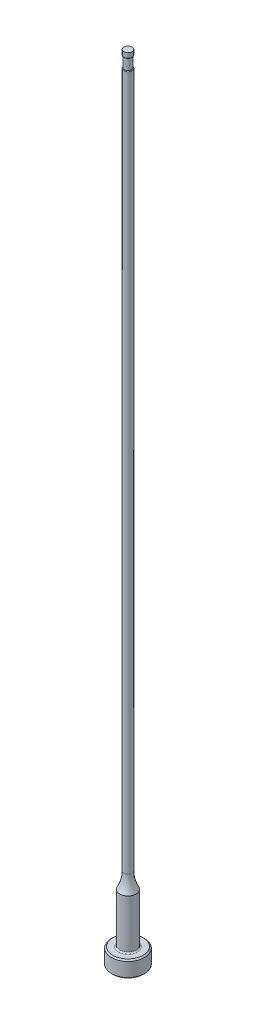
ISO-10303-21;
HEADER;
FILE_DESCRIPTION(('STEP AP214'),'2;1');
FILE_NAME('part.step','',(''),(''),'','','');
FILE_SCHEMA(('AUTOMOTIVE_DESIGN { 1 0 10303 214 1 1 1 1 }'));
ENDSEC;
DATA;
#1=APPLICATION_CONTEXT('core data for automotive mechanical design processes');
#2=APPLICATION_PROTOCOL_DEFINITION('international standard','automotive_design',2000,#1);
#3=PRODUCT_CONTEXT('',#1,'mechanical');
#4=PRODUCT('Part','Part','',(#3));
#5=PRODUCT_RELATED_PRODUCT_CATEGORY('part','',(#4));
#6=PRODUCT_DEFINITION_FORMATION('','',#4);
#7=PRODUCT_DEFINITION_CONTEXT('part definition',#1,'design');
#8=PRODUCT_DEFINITION('design','',#6,#7);
#9=PRODUCT_DEFINITION_SHAPE('','',#8);
#10=(LENGTH_UNIT() NAMED_UNIT(*) SI_UNIT(.MILLI.,.METRE.));
#11=(NAMED_UNIT(*) PLANE_ANGLE_UNIT() SI_UNIT($,.RADIAN.));
#12=(NAMED_UNIT(*) SI_UNIT($,.STERADIAN.) SOLID_ANGLE_UNIT());
#13=UNCERTAINTY_MEASURE_WITH_UNIT(LENGTH_MEASURE(1.E-05),#10,'distance_accuracy_value','');
#14=(GEOMETRIC_REPRESENTATION_CONTEXT(3) GLOBAL_UNCERTAINTY_ASSIGNED_CONTEXT((#13)) GLOBAL_UNIT_ASSIGNED_CONTEXT((#10,
#11,#12)) REPRESENTATION_CONTEXT('',''));
#15=CARTESIAN_POINT('',(0.,0.,0.));
#16=DIRECTION('',(0.,0.,1.));
#17=DIRECTION('',(1.,0.,0.));
#18=AXIS2_PLACEMENT_3D('',#15,#16,#17);
#19=CARTESIAN_POINT('',(0.,259.958771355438,0.));
#20=DIRECTION('',(0.,1.,0.));
#21=DIRECTION('',(0.,0.,1.));
#22=AXIS2_PLACEMENT_3D('',#19,#20,#21);
#23=CYLINDRICAL_SURFACE('',#22,0.79374999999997);
#24=DIRECTION('',(0.,1.,0.));
#25=VECTOR('',#24,1.);
#26=CARTESIAN_POINT('',(-0.692149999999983,259.958771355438,-0.388545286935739));
#27=LINE('',#26,#25);
#28=CARTESIAN_POINT('',(-0.692149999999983,149.227565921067,-0.388545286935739));
#29=VERTEX_POINT('',#28);
#30=CARTESIAN_POINT('',(-0.692149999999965,112.268,-0.388545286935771));
#31=VERTEX_POINT('',#30);
#32=EDGE_CURVE('E66',#29,#31,#27,.F.);
#33=ORIENTED_EDGE('',*,*,#32,.F.);
#34=CARTESIAN_POINT('',(0.,149.227565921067,0.));
#35=DIRECTION('',(0.,1.,0.));
#36=DIRECTION('',(0.,0.,1.));
#37=AXIS2_PLACEMENT_3D('',#34,#35,#36);
#38=CIRCLE('',#37,0.79374999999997);
#39=CARTESIAN_POINT('',(-0.692149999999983,149.227565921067,0.388545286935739));
#40=VERTEX_POINT('',#39);
#41=EDGE_CURVE('E44',#29,#40,#38,.F.);
#42=ORIENTED_EDGE('',*,*,#41,.T.);
#43=DIRECTION('',(0.,1.,0.));
#44=VECTOR('',#43,1.);
#45=CARTESIAN_POINT('',(-0.692149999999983,259.958771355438,0.388545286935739));
#46=LINE('',#45,#44);
#47=CARTESIAN_POINT('',(-0.692149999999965,112.268,0.388545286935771));
#48=VERTEX_POINT('',#47);
#49=EDGE_CURVE('E72',#48,#40,#46,.T.);
#50=ORIENTED_EDGE('',*,*,#49,.F.);
#51=CARTESIAN_POINT('',(-0.692149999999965,112.268,-0.388545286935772));
#52=CARTESIAN_POINT('',(-0.692147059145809,112.234595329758,-0.388529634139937));
#53=CARTESIAN_POINT('',(-0.692677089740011,112.201184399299,-0.387605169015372));
#54=CARTESIAN_POINT('',(-0.694785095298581,112.134441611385,-0.383825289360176));
#55=CARTESIAN_POINT('',(-0.696365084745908,112.101110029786,-0.380966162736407));
#56=CARTESIAN_POINT('',(-0.700560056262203,112.034665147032,-0.373193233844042));
#57=CARTESIAN_POINT('',(-0.703177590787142,112.001552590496,-0.368274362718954));
#58=CARTESIAN_POINT('',(-0.70939790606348,111.935866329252,-0.356147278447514));
#59=CARTESIAN_POINT('',(-0.712999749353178,111.903292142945,-0.348941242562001));
#60=CARTESIAN_POINT('',(-0.720516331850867,111.843629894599,-0.333107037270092));
#61=CARTESIAN_POINT('',(-0.724309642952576,111.816432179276,-0.324837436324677));
#62=CARTESIAN_POINT('',(-0.732469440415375,111.762890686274,-0.305996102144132));
#63=CARTESIAN_POINT('',(-0.736836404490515,111.736547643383,-0.295422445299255));
#64=CARTESIAN_POINT('',(-0.746025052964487,111.684994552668,-0.271391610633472));
#65=CARTESIAN_POINT('',(-0.75085027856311,111.659796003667,-0.257910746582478));
#66=CARTESIAN_POINT('',(-0.760636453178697,111.611650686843,-0.227438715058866));
#67=CARTESIAN_POINT('',(-0.765596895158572,111.588696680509,-0.210459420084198));
#68=CARTESIAN_POINT('',(-0.772863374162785,111.556559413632,-0.181185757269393));
#69=CARTESIAN_POINT('',(-0.775317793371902,111.545987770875,-0.170459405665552));
#70=CARTESIAN_POINT('',(-0.779981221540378,111.526302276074,-0.147661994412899));
#71=CARTESIAN_POINT('',(-0.782190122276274,111.517189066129,-0.135590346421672));
#72=CARTESIAN_POINT('',(-0.786212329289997,111.50084932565,-0.10990918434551));
#73=CARTESIAN_POINT('',(-0.788019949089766,111.493649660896,-0.0962812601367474));
#74=CARTESIAN_POINT('',(-0.790974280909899,111.481994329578,-0.0678329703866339));
#75=CARTESIAN_POINT('',(-0.792122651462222,111.477531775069,-0.0530157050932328));
#76=CARTESIAN_POINT('',(-0.793477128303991,111.472282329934,-0.0246588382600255));
#77=CARTESIAN_POINT('',(-0.793785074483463,111.471097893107,-0.0111986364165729));
#78=CARTESIAN_POINT('',(-0.793708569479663,111.471392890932,0.0156909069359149));
#79=CARTESIAN_POINT('',(-0.793324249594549,111.472871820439,0.0291202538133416));
#80=CARTESIAN_POINT('',(-0.792034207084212,111.477877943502,0.0533347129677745));
#81=CARTESIAN_POINT('',(-0.791220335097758,111.481045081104,0.064202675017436));
#82=CARTESIAN_POINT('',(-0.789221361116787,111.488900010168,0.0853309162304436));
#83=CARTESIAN_POINT('',(-0.78803617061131,111.493588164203,0.0955910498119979));
#84=CARTESIAN_POINT('',(-0.784691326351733,111.506986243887,0.120537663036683));
#85=CARTESIAN_POINT('',(-0.782345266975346,111.516520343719,0.134755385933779));
#86=CARTESIAN_POINT('',(-0.777271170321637,111.537662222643,0.161475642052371));
#87=CARTESIAN_POINT('',(-0.774542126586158,111.549275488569,0.173973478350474));
#88=CARTESIAN_POINT('',(-0.76709792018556,111.581902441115,0.204925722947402));
#89=CARTESIAN_POINT('',(-0.762235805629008,111.604152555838,0.222031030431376));
#90=CARTESIAN_POINT('',(-0.752599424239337,111.650926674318,0.252764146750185));
#91=CARTESIAN_POINT('',(-0.747825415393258,111.675456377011,0.26638290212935));
#92=CARTESIAN_POINT('',(-0.734693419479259,111.747796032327,0.30145019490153));
#93=CARTESIAN_POINT('',(-0.726816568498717,111.797351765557,0.319450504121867));
#94=CARTESIAN_POINT('',(-0.713277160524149,111.898727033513,0.348596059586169));
#95=CARTESIAN_POINT('',(-0.707621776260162,111.950553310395,0.359719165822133));
#96=CARTESIAN_POINT('',(-0.699557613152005,112.046820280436,0.375130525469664));
#97=CARTESIAN_POINT('',(-0.696772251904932,112.091103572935,0.380231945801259));
#98=CARTESIAN_POINT('',(-0.693072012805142,112.179601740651,0.386898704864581));
#99=CARTESIAN_POINT('',(-0.692139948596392,112.223813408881,0.388496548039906));
#100=CARTESIAN_POINT('',(-0.692149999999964,112.268,0.388545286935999));
#101=B_SPLINE_CURVE_WITH_KNOTS('',3,(#51,#52,#53,#54,#55,#56,#57,#58,#59,#60,#61,#62,#63,#64,
#65,#66,#67,#68,#69,#70,#71,#72,#73,#74,#75,#76,#77,#78,#79,#80,#81,#82,#83,#84,#85,#86,#87,#88,
#89,#90,#91,#92,#93,#94,#95,#96,#97,#98,#99,#100),.UNSPECIFIED.,.F.,.F.,(4,2,2,2,2,2,2,2,2,2,2,
2,2,2,2,2,2,2,2,2,2,2,2,2,4),(0.,0.100207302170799,0.20060742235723,0.30125608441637,
0.401809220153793,0.487757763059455,0.573778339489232,0.660528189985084,0.746988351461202,
0.792665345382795,0.838362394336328,0.884670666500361,0.930861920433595,0.971137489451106,
1.01140542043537,1.04531885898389,1.0792403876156,1.13077999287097,1.1824576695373,
1.26742509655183,1.35261096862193,1.51165072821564,1.67119985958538,1.80500866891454,
1.93757071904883),.UNSPECIFIED.);
#102=EDGE_CURVE('E74',#31,#48,#101,.T.);
#103=ORIENTED_EDGE('',*,*,#102,.F.);
#104=EDGE_LOOP('',(#33,#42,#50,#103));
#105=FACE_BOUND('',#104,.T.);
#106=CARTESIAN_POINT('',(0.,15.7741805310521,0.));
#107=DIRECTION('',(0.,1.,0.));
#108=DIRECTION('',(0.,0.,1.));
#109=AXIS2_PLACEMENT_3D('',#106,#107,#108);
#110=CIRCLE('',#109,0.79374999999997);
#111=CARTESIAN_POINT('',(0.,15.7741805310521,0.79374999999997));
#112=VERTEX_POINT('',#111);
#113=EDGE_CURVE('E95',#112,#112,#110,.T.);
#114=ORIENTED_EDGE('',*,*,#113,.T.);
#115=EDGE_LOOP('',(#114));
#116=FACE_BOUND('',#115,.T.);
#117=ADVANCED_FACE('F36',(#105,#116),#23,.T.);
#118=CARTESIAN_POINT('',(0.,15.7741805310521,0.));
#119=DIRECTION('',(0.,1.,0.));
#120=DIRECTION('',(0.,0.,1.));
#121=AXIS2_PLACEMENT_3D('',#118,#119,#120);
#122=TOROIDAL_SURFACE('',#121,7.14374999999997,6.35);
#123=CARTESIAN_POINT('',(0.,12.7,0.));
#124=DIRECTION('',(0.,1.,0.));
#125=DIRECTION('',(0.,0.,1.));
#126=AXIS2_PLACEMENT_3D('',#123,#124,#125);
#127=CIRCLE('',#126,1.58749999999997);
#128=CARTESIAN_POINT('',(0.,12.7,1.58749999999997));
#129=VERTEX_POINT('',#128);
#130=EDGE_CURVE('E92',#129,#129,#127,.T.);
#131=ORIENTED_EDGE('',*,*,#130,.T.);
#132=EDGE_LOOP('',(#131));
#133=FACE_BOUND('',#132,.T.);
#134=ORIENTED_EDGE('',*,*,#113,.F.);
#135=EDGE_LOOP('',(#134));
#136=FACE_BOUND('',#135,.T.);
#137=ADVANCED_FACE('F156',(#133,#136),#122,.F.);
#138=CARTESIAN_POINT('',(0.,259.958771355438,0.));
#139=DIRECTION('',(0.,1.,0.));
#140=DIRECTION('',(0.,0.,1.));
#141=AXIS2_PLACEMENT_3D('',#138,#139,#140);
#142=CYLINDRICAL_SURFACE('',#141,1.58749999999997);
#143=CARTESIAN_POINT('',(0.,3.42900000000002,0.));
#144=DIRECTION('',(0.,1.,0.));
#145=DIRECTION('',(0.,0.,1.));
#146=AXIS2_PLACEMENT_3D('',#143,#144,#145);
#147=CIRCLE('',#146,1.58749999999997);
#148=CARTESIAN_POINT('',(0.,3.42900000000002,1.58749999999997));
#149=VERTEX_POINT('',#148);
#150=EDGE_CURVE('E110',#149,#149,#147,.T.);
#151=ORIENTED_EDGE('',*,*,#150,.T.);
#152=EDGE_LOOP('',(#151));
#153=FACE_BOUND('',#152,.T.);
#154=ORIENTED_EDGE('',*,*,#130,.F.);
#155=EDGE_LOOP('',(#154));
#156=FACE_BOUND('',#155,.T.);
#157=ADVANCED_FACE('F153',(#153,#156),#142,.T.);
#158=CARTESIAN_POINT('',(-3.17499999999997,3.175,0.));
#159=DIRECTION('',(0.,1.,0.));
#160=DIRECTION('',(0.,0.,1.));
#161=AXIS2_PLACEMENT_3D('',#158,#159,#160);
#162=PLANE('',#161);
#163=CARTESIAN_POINT('',(0.,3.175,0.));
#164=DIRECTION('',(0.,1.,0.));
#165=DIRECTION('',(0.,0.,1.));
#166=AXIS2_PLACEMENT_3D('',#163,#164,#165);
#167=CIRCLE('',#166,1.84149999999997);
#168=CARTESIAN_POINT('',(0.,3.175,1.84149999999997));
#169=VERTEX_POINT('',#168);
#170=EDGE_CURVE('E78',#169,#169,#167,.F.);
#171=ORIENTED_EDGE('',*,*,#170,.T.);
#172=EDGE_LOOP('',(#171));
#173=FACE_BOUND('',#172,.T.);
#174=CARTESIAN_POINT('',(0.,3.175,0.));
#175=DIRECTION('',(0.,1.,0.));
#176=DIRECTION('',(0.,0.,1.));
#177=AXIS2_PLACEMENT_3D('',#174,#175,#176);
#178=CIRCLE('',#177,2.92099999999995);
#179=CARTESIAN_POINT('',(0.,3.175,2.92099999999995));
#180=VERTEX_POINT('',#179);
#181=EDGE_CURVE('E98',#180,#180,#178,.T.);
#182=ORIENTED_EDGE('',*,*,#181,.T.);
#183=EDGE_LOOP('',(#182));
#184=FACE_BOUND('',#183,.T.);
#185=ADVANCED_FACE('F149',(#173,#184),#162,.T.);
#186=CARTESIAN_POINT('',(0.,259.958771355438,0.));
#187=DIRECTION('',(0.,1.,0.));
#188=DIRECTION('',(0.,0.,1.));
#189=AXIS2_PLACEMENT_3D('',#186,#187,#188);
#190=CYLINDRICAL_SURFACE('',#189,3.17499999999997);
#191=CARTESIAN_POINT('',(0.,2.92100000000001,0.));
#192=DIRECTION('',(0.,1.,0.));
#193=DIRECTION('',(0.,0.,1.));
#194=AXIS2_PLACEMENT_3D('',#191,#192,#193);
#195=CIRCLE('',#194,3.17499999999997);
#196=CARTESIAN_POINT('',(0.,2.92100000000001,3.17499999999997));
#197=VERTEX_POINT('',#196);
#198=EDGE_CURVE('E104',#197,#197,#195,.F.);
#199=ORIENTED_EDGE('',*,*,#198,.T.);
#200=EDGE_LOOP('',(#199));
#201=FACE_BOUND('',#200,.T.);
#202=CARTESIAN_POINT('',(0.,0.254000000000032,0.));
#203=DIRECTION('',(0.,-1.,0.));
#204=DIRECTION('',(0.,0.,-1.));
#205=AXIS2_PLACEMENT_3D('',#202,#203,#204);
#206=CIRCLE('',#205,3.17499999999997);
#207=CARTESIAN_POINT('',(0.,0.254000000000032,-3.17499999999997));
#208=VERTEX_POINT('',#207);
#209=EDGE_CURVE('E101',#208,#208,#206,.F.);
#210=ORIENTED_EDGE('',*,*,#209,.T.);
#211=EDGE_LOOP('',(#210));
#212=FACE_BOUND('',#211,.T.);
#213=ADVANCED_FACE('F145',(#201,#212),#190,.T.);
#214=CARTESIAN_POINT('',(0.,0.,0.));
#215=DIRECTION('',(0.,-1.,0.));
#216=DIRECTION('',(0.,0.,-1.));
#217=AXIS2_PLACEMENT_3D('',#214,#215,#216);
#218=PLANE('',#217);
#219=CARTESIAN_POINT('',(0.,0.,0.));
#220=DIRECTION('',(0.,-1.,0.));
#221=DIRECTION('',(0.,0.,-1.));
#222=AXIS2_PLACEMENT_3D('',#219,#220,#221);
#223=CIRCLE('',#222,2.92099999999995);
#224=CARTESIAN_POINT('',(0.,0.,-2.92099999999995));
#225=VERTEX_POINT('',#224);
#226=EDGE_CURVE('E107',#225,#225,#223,.T.);
#227=ORIENTED_EDGE('',*,*,#226,.T.);
#228=EDGE_LOOP('',(#227));
#229=FACE_BOUND('',#228,.T.);
#230=ADVANCED_FACE('F141',(#229),#218,.T.);
#231=CARTESIAN_POINT('',(0.,3.17499999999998,0.));
#232=DIRECTION('',(0.,-1.,0.));
#233=DIRECTION('',(0.,0.,-1.));
#234=AXIS2_PLACEMENT_3D('',#231,#232,#233);
#235=CONICAL_SURFACE('',#234,2.92099999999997,0.7853981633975);
#236=ORIENTED_EDGE('',*,*,#198,.F.);
#237=EDGE_LOOP('',(#236));
#238=FACE_BOUND('',#237,.T.);
#239=ORIENTED_EDGE('',*,*,#181,.F.);
#240=EDGE_LOOP('',(#239));
#241=FACE_BOUND('',#240,.T.);
#242=ADVANCED_FACE('F144',(#238,#241),#235,.T.);
#243=CARTESIAN_POINT('',(0.,0.254000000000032,0.));
#244=DIRECTION('',(0.,1.,0.));
#245=DIRECTION('',(0.,0.,1.));
#246=AXIS2_PLACEMENT_3D('',#243,#244,#245);
#247=CONICAL_SURFACE('',#246,3.17499999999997,0.785398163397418);
#248=ORIENTED_EDGE('',*,*,#226,.F.);
#249=EDGE_LOOP('',(#248));
#250=FACE_BOUND('',#249,.T.);
#251=ORIENTED_EDGE('',*,*,#209,.F.);
#252=EDGE_LOOP('',(#251));
#253=FACE_BOUND('',#252,.T.);
#254=ADVANCED_FACE('F245',(#250,#253),#247,.T.);
#255=CARTESIAN_POINT('',(0.,3.42900000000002,0.));
#256=DIRECTION('',(0.,1.,0.));
#257=DIRECTION('',(0.,0.,1.));
#258=AXIS2_PLACEMENT_3D('',#255,#256,#257);
#259=TOROIDAL_SURFACE('',#258,1.84149999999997,0.254);
#260=ORIENTED_EDGE('',*,*,#170,.F.);
#261=EDGE_LOOP('',(#260));
#262=FACE_BOUND('',#261,.T.);
#263=ORIENTED_EDGE('',*,*,#150,.F.);
#264=EDGE_LOOP('',(#263));
#265=FACE_BOUND('',#264,.T.);
#266=ADVANCED_FACE('F139',(#262,#265),#259,.F.);
#267=CARTESIAN_POINT('',(0.,153.448281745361,0.));
#268=DIRECTION('',(0.,1.,0.));
#269=DIRECTION('',(0.,0.,1.));
#270=AXIS2_PLACEMENT_3D('',#267,#268,#269);
#271=CYLINDRICAL_SURFACE('',#270,0.69214999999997);
#272=CARTESIAN_POINT('',(0.,151.384,0.));
#273=DIRECTION('',(0.,1.,0.));
#274=DIRECTION('',(0.,0.,1.));
#275=AXIS2_PLACEMENT_3D('',#272,#273,#274);
#276=CIRCLE('',#275,0.69214999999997);
#277=CARTESIAN_POINT('',(0.,151.384,0.69214999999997));
#278=VERTEX_POINT('',#277);
#279=EDGE_CURVE('E71',#278,#278,#276,.T.);
#280=ORIENTED_EDGE('',*,*,#279,.F.);
#281=EDGE_LOOP('',(#280));
#282=FACE_BOUND('',#281,.T.);
#283=CARTESIAN_POINT('',(0.,149.352,0.));
#284=DIRECTION('',(0.,1.,0.));
#285=DIRECTION('',(0.,0.,1.));
#286=AXIS2_PLACEMENT_3D('',#283,#284,#285);
#287=CIRCLE('',#286,0.69214999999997);
#288=CARTESIAN_POINT('',(-0.69214999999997,149.352,0.));
#289=VERTEX_POINT('',#288);
#290=EDGE_CURVE('E89',#289,#289,#287,.T.);
#291=ORIENTED_EDGE('',*,*,#290,.T.);
#292=EDGE_LOOP('',(#291));
#293=FACE_BOUND('',#292,.T.);
#294=ADVANCED_FACE('F136',(#282,#293),#271,.T.);
#295=CARTESIAN_POINT('',(-0.69214999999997,150.368,-3.17499999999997));
#296=DIRECTION('',(1.,0.,0.));
#297=DIRECTION('',(0.,1.,0.));
#298=AXIS2_PLACEMENT_3D('',#295,#296,#297);
#299=PLANE('',#298);
#300=CARTESIAN_POINT('',(-0.692149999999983,149.227565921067,0.388545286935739));
#301=CARTESIAN_POINT('',(-0.692149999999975,149.231289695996,0.388553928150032));
#302=CARTESIAN_POINT('',(-0.692149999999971,149.235004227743,0.388211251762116));
#303=CARTESIAN_POINT('',(-0.692149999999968,149.242289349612,0.386898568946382));
#304=CARTESIAN_POINT('',(-0.692149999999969,149.245860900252,0.38593396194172));
#305=CARTESIAN_POINT('',(-0.69214999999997,149.252791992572,0.383453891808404));
#306=CARTESIAN_POINT('',(-0.69214999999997,149.25615209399,0.381939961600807));
#307=CARTESIAN_POINT('',(-0.69214999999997,149.26263226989,0.378456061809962));
#308=CARTESIAN_POINT('',(-0.69214999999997,149.265751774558,0.376485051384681));
#309=CARTESIAN_POINT('',(-0.69214999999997,149.27366563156,0.37078408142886));
#310=CARTESIAN_POINT('',(-0.69214999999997,149.278235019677,0.366742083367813));
#311=CARTESIAN_POINT('',(-0.69214999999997,149.286692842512,0.358002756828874));
#312=CARTESIAN_POINT('',(-0.69214999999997,149.290579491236,0.353303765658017));
#313=CARTESIAN_POINT('',(-0.69214999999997,149.300363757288,0.339903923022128));
#314=CARTESIAN_POINT('',(-0.69214999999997,149.305670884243,0.330775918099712));
#315=CARTESIAN_POINT('',(-0.69214999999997,149.314938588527,0.31187396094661));
#316=CARTESIAN_POINT('',(-0.69214999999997,149.318895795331,0.302098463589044));
#317=CARTESIAN_POINT('',(-0.69214999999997,149.32735470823,0.277716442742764));
#318=CARTESIAN_POINT('',(-0.69214999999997,149.33129702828,0.262919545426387));
#319=CARTESIAN_POINT('',(-0.69214999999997,149.337750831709,0.233007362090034));
#320=CARTESIAN_POINT('',(-0.69214999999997,149.340258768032,0.21789138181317));
#321=CARTESIAN_POINT('',(-0.69214999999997,149.346375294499,0.172181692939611));
#322=CARTESIAN_POINT('',(-0.69214999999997,149.348529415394,0.141404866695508));
#323=CARTESIAN_POINT('',(-0.69214999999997,149.350692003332,0.092070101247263));
#324=CARTESIAN_POINT('',(-0.69214999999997,149.351212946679,0.0735164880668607));
#325=CARTESIAN_POINT('',(-0.69214999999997,149.351853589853,0.0366435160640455));
#326=CARTESIAN_POINT('',(-0.69214999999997,149.351978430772,0.0183242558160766));
#327=CARTESIAN_POINT('',(-0.69214999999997,149.352,0.));
#328=B_SPLINE_CURVE_WITH_KNOTS('',3,(#300,#301,#302,#303,#304,#305,#306,#307,#308,#309,#310,
#311,#312,#313,#314,#315,#316,#317,#318,#319,#320,#321,#322,#323,#324,#325,#326,#327),
.UNSPECIFIED.,.F.,.F.,(4,2,2,2,2,2,2,2,2,2,2,2,2,4),(0.,0.0111408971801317,0.0221863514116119,
0.0332012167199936,0.0442414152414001,0.0624374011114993,0.0806802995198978,0.112177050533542,
0.143751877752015,0.189567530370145,0.235495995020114,0.327902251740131,0.383589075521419,
0.438550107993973),.UNSPECIFIED.);
#329=EDGE_CURVE('E77',#40,#289,#328,.T.);
#330=ORIENTED_EDGE('',*,*,#329,.T.);
#331=CARTESIAN_POINT('',(-0.69214999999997,149.352,0.));
#332=CARTESIAN_POINT('',(-0.69214999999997,149.351997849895,-0.0105245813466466));
#333=CARTESIAN_POINT('',(-0.69214999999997,149.351951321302,-0.0210488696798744));
#334=CARTESIAN_POINT('',(-0.69214999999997,149.35175049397,-0.0420982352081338));
#335=CARTESIAN_POINT('',(-0.69214999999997,149.351596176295,-0.0526233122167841));
#336=CARTESIAN_POINT('',(-0.69214999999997,149.350939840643,-0.0843503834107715));
#337=CARTESIAN_POINT('',(-0.69214999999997,149.350243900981,-0.105550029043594));
#338=CARTESIAN_POINT('',(-0.69214999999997,149.347914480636,-0.148128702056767));
#339=CARTESIAN_POINT('',(-0.69214999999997,149.346271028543,-0.169507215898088));
#340=CARTESIAN_POINT('',(-0.69214999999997,149.341296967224,-0.212034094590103));
#341=CARTESIAN_POINT('',(-0.69214999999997,149.33797232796,-0.233183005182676));
#342=CARTESIAN_POINT('',(-0.69214999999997,149.331208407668,-0.262553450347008));
#343=CARTESIAN_POINT('',(-0.69214999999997,149.328990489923,-0.27105086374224));
#344=CARTESIAN_POINT('',(-0.69214999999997,149.323911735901,-0.287887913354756));
#345=CARTESIAN_POINT('',(-0.69214999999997,149.321048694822,-0.296226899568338));
#346=CARTESIAN_POINT('',(-0.69214999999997,149.313703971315,-0.314648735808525));
#347=CARTESIAN_POINT('',(-0.69214999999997,149.308996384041,-0.324643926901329));
#348=CARTESIAN_POINT('',(-0.69214999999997,149.297902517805,-0.343648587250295));
#349=CARTESIAN_POINT('',(-0.69214999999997,149.291528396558,-0.352664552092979));
#350=CARTESIAN_POINT('',(-0.69214999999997,149.281016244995,-0.363960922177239));
#351=CARTESIAN_POINT('',(-0.69214999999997,149.277779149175,-0.367075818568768));
#352=CARTESIAN_POINT('',(-0.69214999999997,149.270910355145,-0.372849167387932));
#353=CARTESIAN_POINT('',(-0.69214999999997,149.267278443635,-0.375507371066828));
#354=CARTESIAN_POINT('',(-0.69214999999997,149.259582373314,-0.380238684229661));
#355=CARTESIAN_POINT('',(-0.69214999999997,149.25551340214,-0.382304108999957));
#356=CARTESIAN_POINT('',(-0.69214999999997,149.247058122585,-0.385614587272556));
#357=CARTESIAN_POINT('',(-0.69214999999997,149.242672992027,-0.386862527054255));
#358=CARTESIAN_POINT('',(-0.69214999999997,149.236454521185,-0.387934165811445));
#359=CARTESIAN_POINT('',(-0.69214999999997,149.234685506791,-0.388162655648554));
#360=CARTESIAN_POINT('',(-0.69214999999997,149.231133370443,-0.388468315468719));
#361=CARTESIAN_POINT('',(-0.69214999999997,149.2293502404,-0.388545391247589));
#362=CARTESIAN_POINT('',(-0.69214999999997,149.227565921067,-0.388545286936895));
#363=B_SPLINE_CURVE_WITH_KNOTS('',3,(#331,#332,#333,#334,#335,#336,#337,#338,#339,#340,#341,
#342,#343,#344,#345,#346,#347,#348,#349,#350,#351,#352,#353,#354,#355,#356,#357,#358,#359,#360,
#361,#362),.UNSPECIFIED.,.F.,.F.,(4,2,2,2,2,2,2,2,2,2,2,2,2,2,2,4),(0.,0.0315729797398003,
0.0631515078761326,0.126771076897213,0.191072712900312,0.255147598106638,0.281475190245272,
0.307894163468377,0.340944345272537,0.373759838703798,0.387205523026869,0.40065850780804,
0.414278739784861,0.427850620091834,0.433196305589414,0.438545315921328),.UNSPECIFIED.);
#364=EDGE_CURVE('E58',#289,#29,#363,.T.);
#365=ORIENTED_EDGE('',*,*,#364,.T.);
#366=ORIENTED_EDGE('',*,*,#32,.T.);
#367=DIRECTION('',(0.,0.,1.));
#368=VECTOR('',#367,1.);
#369=CARTESIAN_POINT('',(-0.692149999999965,112.268,-3.17499999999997));
#370=LINE('',#369,#368);
#371=EDGE_CURVE('E70',#31,#48,#370,.T.);
#372=ORIENTED_EDGE('',*,*,#371,.T.);
#373=ORIENTED_EDGE('',*,*,#49,.T.);
#374=EDGE_LOOP('',(#330,#365,#366,#372,#373));
#375=FACE_BOUND('',#374,.T.);
#376=ADVANCED_FACE('F68',(#375),#299,.F.);
#377=CARTESIAN_POINT('',(-3.86714999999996,112.268,-3.17499999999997));
#378=DIRECTION('',(0.,0.,1.));
#379=DIRECTION('',(1.,0.,0.));
#380=AXIS2_PLACEMENT_3D('',#377,#378,#379);
#381=CYLINDRICAL_SURFACE('',#380,3.175);
#382=ORIENTED_EDGE('',*,*,#371,.F.);
#383=ORIENTED_EDGE('',*,*,#102,.T.);
#384=EDGE_LOOP('',(#382,#383));
#385=FACE_BOUND('',#384,.T.);
#386=ADVANCED_FACE('F80',(#385),#381,.F.);
#387=CARTESIAN_POINT('',(0.,152.687735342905,0.));
#388=DIRECTION('',(0.,1.,0.));
#389=DIRECTION('',(0.,0.,1.));
#390=AXIS2_PLACEMENT_3D('',#387,#388,#389);
#391=CYLINDRICAL_SURFACE('',#390,0.78866999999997);
#392=CARTESIAN_POINT('',(0.,151.507288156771,0.));
#393=DIRECTION('',(0.,-1.,0.));
#394=DIRECTION('',(0.,0.,-1.));
#395=AXIS2_PLACEMENT_3D('',#392,#393,#394);
#396=CIRCLE('',#395,0.78866999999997);
#397=CARTESIAN_POINT('',(0.,151.507288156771,-0.78866999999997));
#398=VERTEX_POINT('',#397);
#399=EDGE_CURVE('E11',#398,#398,#396,.F.);
#400=ORIENTED_EDGE('',*,*,#399,.T.);
#401=EDGE_LOOP('',(#400));
#402=FACE_BOUND('',#401,.T.);
#403=CARTESIAN_POINT('',(0.,152.4,0.));
#404=DIRECTION('',(0.,1.,0.));
#405=DIRECTION('',(0.,0.,1.));
#406=AXIS2_PLACEMENT_3D('',#403,#404,#405);
#407=CIRCLE('',#406,0.78866999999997);
#408=CARTESIAN_POINT('',(0.,152.4,0.78866999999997));
#409=VERTEX_POINT('',#408);
#410=EDGE_CURVE('E81',#409,#409,#407,.T.);
#411=ORIENTED_EDGE('',*,*,#410,.F.);
#412=EDGE_LOOP('',(#411));
#413=FACE_BOUND('',#412,.T.);
#414=ADVANCED_FACE('F133',(#402,#413),#391,.T.);
#415=CARTESIAN_POINT('',(-0.79374999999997,152.4,0.));
#416=DIRECTION('',(0.,1.,0.));
#417=DIRECTION('',(0.,0.,1.));
#418=AXIS2_PLACEMENT_3D('',#415,#416,#417);
#419=PLANE('',#418);
#420=ORIENTED_EDGE('',*,*,#410,.T.);
#421=EDGE_LOOP('',(#420));
#422=FACE_BOUND('',#421,.T.);
#423=ADVANCED_FACE('F177',(#422),#419,.T.);
#424=CARTESIAN_POINT('',(0.,149.227565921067,0.));
#425=DIRECTION('',(0.,1.,0.));
#426=DIRECTION('',(0.,0.,1.));
#427=AXIS2_PLACEMENT_3D('',#424,#425,#426);
#428=TOROIDAL_SURFACE('',#427,0.66674999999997,0.127);
#429=ORIENTED_EDGE('',*,*,#329,.F.);
#430=ORIENTED_EDGE('',*,*,#41,.F.);
#431=ORIENTED_EDGE('',*,*,#364,.F.);
#432=ORIENTED_EDGE('',*,*,#290,.F.);
#433=EDGE_LOOP('',(#429,#430,#431,#432));
#434=FACE_BOUND('',#433,.T.);
#435=ADVANCED_FACE('F209',(#434),#428,.T.);
#436=CARTESIAN_POINT('',(0.,151.507288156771,0.));
#437=DIRECTION('',(0.,-1.,0.));
#438=DIRECTION('',(0.,0.,-1.));
#439=AXIS2_PLACEMENT_3D('',#436,#437,#438);
#440=TOROIDAL_SURFACE('',#439,0.66166999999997,0.127);
#441=ORIENTED_EDGE('',*,*,#279,.T.);
#442=EDGE_LOOP('',(#441));
#443=FACE_BOUND('',#442,.T.);
#444=ORIENTED_EDGE('',*,*,#399,.F.);
#445=EDGE_LOOP('',(#444));
#446=FACE_BOUND('',#445,.T.);
#447=ADVANCED_FACE('F38',(#443,#446),#440,.T.);
#448=CLOSED_SHELL('',(#117,#137,#157,#185,#213,#230,#242,#254,#266,#294,#376,#386,#414,#423,
#435,#447));
#449=MANIFOLD_SOLID_BREP('B2',#448);
#450=ADVANCED_BREP_SHAPE_REPRESENTATION('',(#18,#449),#14);
#451=SHAPE_DEFINITION_REPRESENTATION(#9,#450);
ENDSEC;
END-ISO-10303-21;
